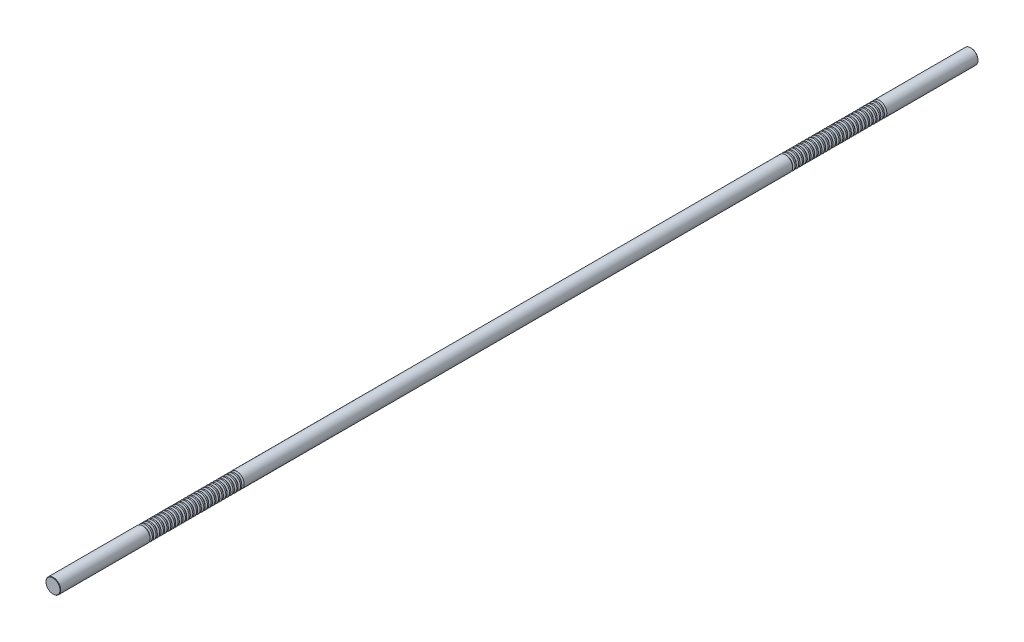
from build123d import *

# Parameters (mm, degrees)
SKETCH1_R           = 8
BOSS_EXTRUDE1_DEPTH = 500
CHAMFER1_SIZE       = 0.4
LPATTERN1_COUNT     = 26
LPATTERN1_PITCH     = 4
LPATTERN2_COUNT     = 2
LPATTERN2_PITCH     = 700


with BuildPart() as part:
    # Sketch1 → Boss-Extrude1 (new, symmetric)
    with BuildSketch(Plane.XY):
        Circle(SKETCH1_R)
    extrude(amount=BOSS_EXTRUDE1_DEPTH, both=True)

    # Chamfer1
    chamfer1_edges = [part.edges().sort_by_distance(p)[0] for p in [
        (-8, 0, -500),
        (-8, 0, 500),
    ]]
    chamfer(chamfer1_edges, length=CHAMFER1_SIZE)

    # Sketch2 → Cut-Revolve1 (revolve, cut)
    with BuildSketch(Plane(origin=(0, 0, 0), x_dir=(0, 0, -1), z_dir=(1, 0, 0)), mode=Mode.PRIVATE) as cut_revolve1_sk:
        Polygon((400.301442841, 8), (397.698557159, 8), (398.301442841, 5.75), (399.698557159, 5.75), align=None)
    cut_revolve1 = revolve(cut_revolve1_sk.sketch.rotate(Axis((0, 0, 500), (0, 0, -1)), 90), axis=Axis((0, 0, 500), (0, 0, -1)), mode=Mode.SUBTRACT)

    # LPattern1: Cut-Revolve1 ×26
    with Locations(*[(0, 0, i * LPATTERN1_PITCH) for i in range(1, LPATTERN1_COUNT)]):
        add(cut_revolve1, mode=Mode.SUBTRACT)

    # LPattern2: Cut-Revolve1 ×2
    with Locations(*[(0, 0, i * LPATTERN2_PITCH) for i in range(1, LPATTERN2_COUNT)]):
        add(cut_revolve1, mode=Mode.SUBTRACT)

    # LPattern2 copy 1 sketch → LPattern2 copy 1 (revolve, cut)
    with BuildSketch(Plane(origin=(0, 0, 704), x_dir=(0, 0, -1), z_dir=(1, 0, 0))):
        Polygon((400.301442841, 8), (397.698557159, 8), (398.301442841, 5.75), (399.698557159, 5.75), align=None)
    revolve(axis=Axis((0, 0, 1204), (0, 0, -1)), mode=Mode.SUBTRACT)

    # LPattern2 copy 2 sketch → LPattern2 copy 2 (revolve, cut)
    with BuildSketch(Plane(origin=(0, 0, 708), x_dir=(0, 0, -1), z_dir=(1, 0, 0))):
        Polygon((400.301442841, 8), (397.698557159, 8), (398.301442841, 5.75), (399.698557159, 5.75), align=None)
    revolve(axis=Axis((0, 0, 1208), (0, 0, -1)), mode=Mode.SUBTRACT)

    # LPattern2 copy 3 sketch → LPattern2 copy 3 (revolve, cut)
    with BuildSketch(Plane(origin=(0, 0, 712), x_dir=(0, 0, -1), z_dir=(1, 0, 0))):
        Polygon((400.301442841, 8), (397.698557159, 8), (398.301442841, 5.75), (399.698557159, 5.75), align=None)
    revolve(axis=Axis((0, 0, 1212), (0, 0, -1)), mode=Mode.SUBTRACT)

    # LPattern2 copy 4 sketch → LPattern2 copy 4 (revolve, cut)
    with BuildSketch(Plane(origin=(0, 0, 716), x_dir=(0, 0, -1), z_dir=(1, 0, 0))):
        Polygon((400.301442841, 8), (397.698557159, 8), (398.301442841, 5.75), (399.698557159, 5.75), align=None)
    revolve(axis=Axis((0, 0, 1216), (0, 0, -1)), mode=Mode.SUBTRACT)

    # LPattern2 copy 5 sketch → LPattern2 copy 5 (revolve, cut)
    with BuildSketch(Plane(origin=(0, 0, 720), x_dir=(0, 0, -1), z_dir=(1, 0, 0))):
        Polygon((400.301442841, 8), (397.698557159, 8), (398.301442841, 5.75), (399.698557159, 5.75), align=None)
    revolve(axis=Axis((0, 0, 1220), (0, 0, -1)), mode=Mode.SUBTRACT)

    # LPattern2 copy 6 sketch → LPattern2 copy 6 (revolve, cut)
    with BuildSketch(Plane(origin=(0, 0, 724), x_dir=(0, 0, -1), z_dir=(1, 0, 0))):
        Polygon((400.301442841, 8), (397.698557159, 8), (398.301442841, 5.75), (399.698557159, 5.75), align=None)
    revolve(axis=Axis((0, 0, 1224), (0, 0, -1)), mode=Mode.SUBTRACT)

    # LPattern2 copy 7 sketch → LPattern2 copy 7 (revolve, cut)
    with BuildSketch(Plane(origin=(0, 0, 728), x_dir=(0, 0, -1), z_dir=(1, 0, 0))):
        Polygon((400.301442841, 8), (397.698557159, 8), (398.301442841, 5.75), (399.698557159, 5.75), align=None)
    revolve(axis=Axis((0, 0, 1228), (0, 0, -1)), mode=Mode.SUBTRACT)

    # LPattern2 copy 8 sketch → LPattern2 copy 8 (revolve, cut)
    with BuildSketch(Plane(origin=(0, 0, 732), x_dir=(0, 0, -1), z_dir=(1, 0, 0))):
        Polygon((400.301442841, 8), (397.698557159, 8), (398.301442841, 5.75), (399.698557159, 5.75), align=None)
    revolve(axis=Axis((0, 0, 1232), (0, 0, -1)), mode=Mode.SUBTRACT)

    # LPattern2 copy 9 sketch → LPattern2 copy 9 (revolve, cut)
    with BuildSketch(Plane(origin=(0, 0, 736), x_dir=(0, 0, -1), z_dir=(1, 0, 0))):
        Polygon((400.301442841, 8), (397.698557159, 8), (398.301442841, 5.75), (399.698557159, 5.75), align=None)
    revolve(axis=Axis((0, 0, 1236), (0, 0, -1)), mode=Mode.SUBTRACT)

    # LPattern2 copy 10 sketch → LPattern2 copy 10 (revolve, cut)
    with BuildSketch(Plane(origin=(0, 0, 740), x_dir=(0, 0, -1), z_dir=(1, 0, 0))):
        Polygon((400.301442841, 8), (397.698557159, 8), (398.301442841, 5.75), (399.698557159, 5.75), align=None)
    revolve(axis=Axis((0, 0, 1240), (0, 0, -1)), mode=Mode.SUBTRACT)

    # LPattern2 copy 11 sketch → LPattern2 copy 11 (revolve, cut)
    with BuildSketch(Plane(origin=(0, 0, 744), x_dir=(0, 0, -1), z_dir=(1, 0, 0))):
        Polygon((400.301442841, 8), (397.698557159, 8), (398.301442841, 5.75), (399.698557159, 5.75), align=None)
    revolve(axis=Axis((0, 0, 1244), (0, 0, -1)), mode=Mode.SUBTRACT)

    # LPattern2 copy 12 sketch → LPattern2 copy 12 (revolve, cut)
    with BuildSketch(Plane(origin=(0, 0, 748), x_dir=(0, 0, -1), z_dir=(1, 0, 0))):
        Polygon((400.301442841, 8), (397.698557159, 8), (398.301442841, 5.75), (399.698557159, 5.75), align=None)
    revolve(axis=Axis((0, 0, 1248), (0, 0, -1)), mode=Mode.SUBTRACT)

    # LPattern2 copy 13 sketch → LPattern2 copy 13 (revolve, cut)
    with BuildSketch(Plane(origin=(0, 0, 752), x_dir=(0, 0, -1), z_dir=(1, 0, 0))):
        Polygon((400.301442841, 8), (397.698557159, 8), (398.301442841, 5.75), (399.698557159, 5.75), align=None)
    revolve(axis=Axis((0, 0, 1252), (0, 0, -1)), mode=Mode.SUBTRACT)

    # LPattern2 copy 14 sketch → LPattern2 copy 14 (revolve, cut)
    with BuildSketch(Plane(origin=(0, 0, 756), x_dir=(0, 0, -1), z_dir=(1, 0, 0))):
        Polygon((400.301442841, 8), (397.698557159, 8), (398.301442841, 5.75), (399.698557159, 5.75), align=None)
    revolve(axis=Axis((0, 0, 1256), (0, 0, -1)), mode=Mode.SUBTRACT)

    # LPattern2 copy 15 sketch → LPattern2 copy 15 (revolve, cut)
    with BuildSketch(Plane(origin=(0, 0, 760), x_dir=(0, 0, -1), z_dir=(1, 0, 0))):
        Polygon((400.301442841, 8), (397.698557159, 8), (398.301442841, 5.75), (399.698557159, 5.75), align=None)
    revolve(axis=Axis((0, 0, 1260), (0, 0, -1)), mode=Mode.SUBTRACT)

    # LPattern2 copy 16 sketch → LPattern2 copy 16 (revolve, cut)
    with BuildSketch(Plane(origin=(0, 0, 764), x_dir=(0, 0, -1), z_dir=(1, 0, 0))):
        Polygon((400.301442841, 8), (397.698557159, 8), (398.301442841, 5.75), (399.698557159, 5.75), align=None)
    revolve(axis=Axis((0, 0, 1264), (0, 0, -1)), mode=Mode.SUBTRACT)

    # LPattern2 copy 17 sketch → LPattern2 copy 17 (revolve, cut)
    with BuildSketch(Plane(origin=(0, 0, 768), x_dir=(0, 0, -1), z_dir=(1, 0, 0))):
        Polygon((400.301442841, 8), (397.698557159, 8), (398.301442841, 5.75), (399.698557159, 5.75), align=None)
    revolve(axis=Axis((0, 0, 1268), (0, 0, -1)), mode=Mode.SUBTRACT)

    # LPattern2 copy 18 sketch → LPattern2 copy 18 (revolve, cut)
    with BuildSketch(Plane(origin=(0, 0, 772), x_dir=(0, 0, -1), z_dir=(1, 0, 0))):
        Polygon((400.301442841, 8), (397.698557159, 8), (398.301442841, 5.75), (399.698557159, 5.75), align=None)
    revolve(axis=Axis((0, 0, 1272), (0, 0, -1)), mode=Mode.SUBTRACT)

    # LPattern2 copy 19 sketch → LPattern2 copy 19 (revolve, cut)
    with BuildSketch(Plane(origin=(0, 0, 776), x_dir=(0, 0, -1), z_dir=(1, 0, 0))):
        Polygon((400.301442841, 8), (397.698557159, 8), (398.301442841, 5.75), (399.698557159, 5.75), align=None)
    revolve(axis=Axis((0, 0, 1276), (0, 0, -1)), mode=Mode.SUBTRACT)

    # LPattern2 copy 20 sketch → LPattern2 copy 20 (revolve, cut)
    with BuildSketch(Plane(origin=(0, 0, 780), x_dir=(0, 0, -1), z_dir=(1, 0, 0))):
        Polygon((400.301442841, 8), (397.698557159, 8), (398.301442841, 5.75), (399.698557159, 5.75), align=None)
    revolve(axis=Axis((0, 0, 1280), (0, 0, -1)), mode=Mode.SUBTRACT)

    # LPattern2 copy 21 sketch → LPattern2 copy 21 (revolve, cut)
    with BuildSketch(Plane(origin=(0, 0, 784), x_dir=(0, 0, -1), z_dir=(1, 0, 0))):
        Polygon((400.301442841, 8), (397.698557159, 8), (398.301442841, 5.75), (399.698557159, 5.75), align=None)
    revolve(axis=Axis((0, 0, 1284), (0, 0, -1)), mode=Mode.SUBTRACT)

    # LPattern2 copy 22 sketch → LPattern2 copy 22 (revolve, cut)
    with BuildSketch(Plane(origin=(0, 0, 788), x_dir=(0, 0, -1), z_dir=(1, 0, 0))):
        Polygon((400.301442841, 8), (397.698557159, 8), (398.301442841, 5.75), (399.698557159, 5.75), align=None)
    revolve(axis=Axis((0, 0, 1288), (0, 0, -1)), mode=Mode.SUBTRACT)

    # LPattern2 copy 23 sketch → LPattern2 copy 23 (revolve, cut)
    with BuildSketch(Plane(origin=(0, 0, 792), x_dir=(0, 0, -1), z_dir=(1, 0, 0))):
        Polygon((400.301442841, 8), (397.698557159, 8), (398.301442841, 5.75), (399.698557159, 5.75), align=None)
    revolve(axis=Axis((0, 0, 1292), (0, 0, -1)), mode=Mode.SUBTRACT)

    # LPattern2 copy 24 sketch → LPattern2 copy 24 (revolve, cut)
    with BuildSketch(Plane(origin=(0, 0, 796), x_dir=(0, 0, -1), z_dir=(1, 0, 0))):
        Polygon((400.301442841, 8), (397.698557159, 8), (398.301442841, 5.75), (399.698557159, 5.75), align=None)
    revolve(axis=Axis((0, 0, 1296), (0, 0, -1)), mode=Mode.SUBTRACT)

    # LPattern2 copy 25 sketch → LPattern2 copy 25 (revolve, cut)
    with BuildSketch(Plane(origin=(0, 0, 800), x_dir=(0, 0, -1), z_dir=(1, 0, 0))):
        Polygon((400.301442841, 8), (397.698557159, 8), (398.301442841, 5.75), (399.698557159, 5.75), align=None)
    revolve(axis=Axis((0, 0, 1300), (0, 0, -1)), mode=Mode.SUBTRACT)


solid = part.part
